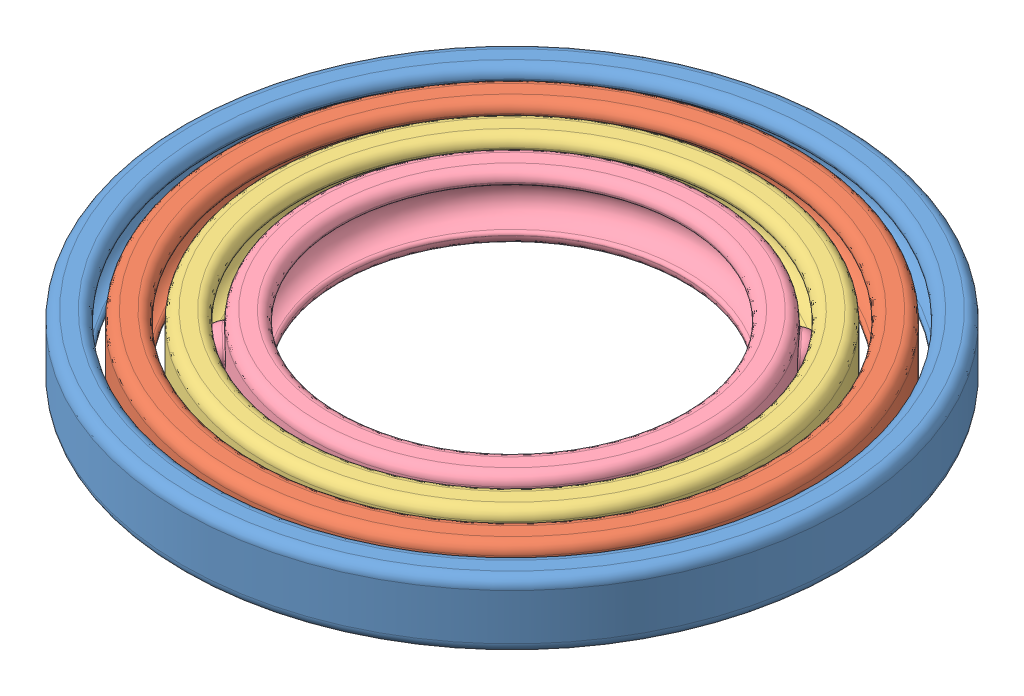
SolidWorks assembly c.SLDASM, configuration 默认 (file format 9000). Lengths in mm.
Overall size (100 10 100).
4 component instances, 4 part files, 6 mates.
Components (placement in the parent):
- c_0-1: c_0.SLDPRT [内2] at origin size (100 10 100)
- c_1-1: c_1.SLDPRT [内2] at origin size (92.5 10 87.2)
- c_2-1: c_2.SLDPRT [内2] at origin size (79.7 10 74.4)
- c_3-1: c_3.SLDPRT [内2] x (0.721019 0 -0.692916) z (0.692916 0 0.721019) size (66.9 10 61.6)
Mates (geometry in assembly coordinates):
- 同心1: concentric aligned: cylinder of c_0-1 through (0 0 0) axis (0 -1 0) radius 50; cylinder of c_1-1 through (0 0 0) axis (0 -1 0) radius 43.6
- 同心2: concentric aligned: circle of c_0-1; circle of c_3-1
- 同心3: concentric aligned: circle of c_2-1; circle of c_3-1
- 重合1: coincident aligned: plane of c_1-1 through (40.1 0 0) normal (0 -1 0); plane of c_2-1 through (33.7 0 0) normal (0 -1 0)
- 重合2: coincident aligned: plane of c_0-1 through (46.5 0 0) normal (0 -1 0); plane of c_1-1 through (40.1 0 0) normal (0 -1 0)
- 重合3: coincident aligned: plane of c_0-1 through (46.5 0 0) normal (0 -1 0); plane of c_3-1 through (19.6838 0 -18.9166) normal (0 -1 0)
